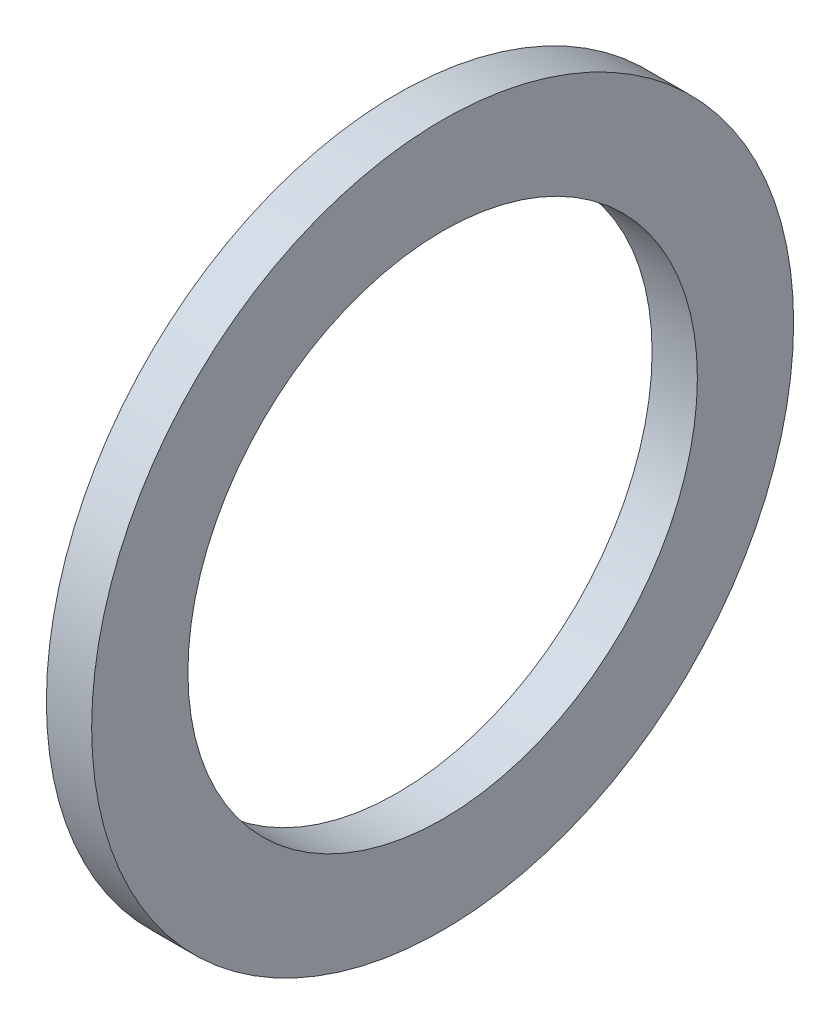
ISO-10303-21;
HEADER;
FILE_DESCRIPTION(('STEP AP214'),'2;1');
FILE_NAME('part.step','',(''),(''),'','','');
FILE_SCHEMA(('AUTOMOTIVE_DESIGN { 1 0 10303 214 1 1 1 1 }'));
ENDSEC;
DATA;
#1=APPLICATION_CONTEXT('core data for automotive mechanical design processes');
#2=APPLICATION_PROTOCOL_DEFINITION('international standard','automotive_design',2000,#1);
#3=PRODUCT_CONTEXT('',#1,'mechanical');
#4=PRODUCT('Part','Part','',(#3));
#5=PRODUCT_RELATED_PRODUCT_CATEGORY('part','',(#4));
#6=PRODUCT_DEFINITION_FORMATION('','',#4);
#7=PRODUCT_DEFINITION_CONTEXT('part definition',#1,'design');
#8=PRODUCT_DEFINITION('design','',#6,#7);
#9=PRODUCT_DEFINITION_SHAPE('','',#8);
#10=(LENGTH_UNIT() NAMED_UNIT(*) SI_UNIT(.MILLI.,.METRE.));
#11=(NAMED_UNIT(*) PLANE_ANGLE_UNIT() SI_UNIT($,.RADIAN.));
#12=(NAMED_UNIT(*) SI_UNIT($,.STERADIAN.) SOLID_ANGLE_UNIT());
#13=UNCERTAINTY_MEASURE_WITH_UNIT(LENGTH_MEASURE(1.E-05),#10,'distance_accuracy_value','');
#14=(GEOMETRIC_REPRESENTATION_CONTEXT(3) GLOBAL_UNCERTAINTY_ASSIGNED_CONTEXT((#13)) GLOBAL_UNIT_ASSIGNED_CONTEXT((#10,
#11,#12)) REPRESENTATION_CONTEXT('',''));
#15=CARTESIAN_POINT('',(0.,0.,0.));
#16=DIRECTION('',(0.,0.,1.));
#17=DIRECTION('',(1.,0.,0.));
#18=AXIS2_PLACEMENT_3D('',#15,#16,#17);
#19=CARTESIAN_POINT('',(2.,0.,0.));
#20=DIRECTION('',(1.,0.,0.));
#21=DIRECTION('',(0.,0.,-1.));
#22=AXIS2_PLACEMENT_3D('',#19,#20,#21);
#23=PLANE('',#22);
#24=CARTESIAN_POINT('',(2.,0.,0.));
#25=DIRECTION('',(1.,0.,0.));
#26=DIRECTION('',(0.,0.,-1.));
#27=AXIS2_PLACEMENT_3D('',#24,#25,#26);
#28=CIRCLE('',#27,15.5);
#29=CARTESIAN_POINT('',(2.,0.,-15.5));
#30=VERTEX_POINT('',#29);
#31=EDGE_CURVE('E10',#30,#30,#28,.T.);
#32=ORIENTED_EDGE('',*,*,#31,.T.);
#33=EDGE_LOOP('',(#32));
#34=FACE_BOUND('',#33,.T.);
#35=CARTESIAN_POINT('',(2.,0.,0.));
#36=DIRECTION('',(1.,0.,0.));
#37=DIRECTION('',(0.,0.,-1.));
#38=AXIS2_PLACEMENT_3D('',#35,#36,#37);
#39=CIRCLE('',#38,11.25);
#40=CARTESIAN_POINT('',(2.,0.,-11.25));
#41=VERTEX_POINT('',#40);
#42=EDGE_CURVE('E38',#41,#41,#39,.T.);
#43=ORIENTED_EDGE('',*,*,#42,.F.);
#44=EDGE_LOOP('',(#43));
#45=FACE_BOUND('',#44,.T.);
#46=ADVANCED_FACE('F27',(#34,#45),#23,.T.);
#47=CARTESIAN_POINT('',(0.,0.,0.));
#48=DIRECTION('',(1.,0.,0.));
#49=DIRECTION('',(0.,0.,-1.));
#50=AXIS2_PLACEMENT_3D('',#47,#48,#49);
#51=PLANE('',#50);
#52=CARTESIAN_POINT('',(0.,0.,0.));
#53=DIRECTION('',(1.,0.,0.));
#54=DIRECTION('',(0.,0.,-1.));
#55=AXIS2_PLACEMENT_3D('',#52,#53,#54);
#56=CIRCLE('',#55,15.5);
#57=CARTESIAN_POINT('',(0.,0.,-15.5));
#58=VERTEX_POINT('',#57);
#59=EDGE_CURVE('E34',#58,#58,#56,.T.);
#60=ORIENTED_EDGE('',*,*,#59,.F.);
#61=EDGE_LOOP('',(#60));
#62=FACE_BOUND('',#61,.T.);
#63=CARTESIAN_POINT('',(0.,0.,0.));
#64=DIRECTION('',(1.,0.,0.));
#65=DIRECTION('',(0.,0.,-1.));
#66=AXIS2_PLACEMENT_3D('',#63,#64,#65);
#67=CIRCLE('',#66,11.25);
#68=CARTESIAN_POINT('',(0.,0.,-11.25));
#69=VERTEX_POINT('',#68);
#70=EDGE_CURVE('E42',#69,#69,#67,.T.);
#71=ORIENTED_EDGE('',*,*,#70,.T.);
#72=EDGE_LOOP('',(#71));
#73=FACE_BOUND('',#72,.T.);
#74=ADVANCED_FACE('F48',(#62,#73),#51,.F.);
#75=CARTESIAN_POINT('',(2.,0.,0.));
#76=DIRECTION('',(-1.,0.,0.));
#77=DIRECTION('',(0.,0.,1.));
#78=AXIS2_PLACEMENT_3D('',#75,#76,#77);
#79=CYLINDRICAL_SURFACE('',#78,15.5);
#80=ORIENTED_EDGE('',*,*,#31,.F.);
#81=EDGE_LOOP('',(#80));
#82=FACE_BOUND('',#81,.T.);
#83=ORIENTED_EDGE('',*,*,#59,.T.);
#84=EDGE_LOOP('',(#83));
#85=FACE_BOUND('',#84,.T.);
#86=ADVANCED_FACE('F29',(#82,#85),#79,.T.);
#87=CARTESIAN_POINT('',(2.,0.,0.));
#88=DIRECTION('',(-1.,0.,0.));
#89=DIRECTION('',(0.,0.,1.));
#90=AXIS2_PLACEMENT_3D('',#87,#88,#89);
#91=CYLINDRICAL_SURFACE('',#90,11.25);
#92=ORIENTED_EDGE('',*,*,#42,.T.);
#93=EDGE_LOOP('',(#92));
#94=FACE_BOUND('',#93,.T.);
#95=ORIENTED_EDGE('',*,*,#70,.F.);
#96=EDGE_LOOP('',(#95));
#97=FACE_BOUND('',#96,.T.);
#98=ADVANCED_FACE('F50',(#94,#97),#91,.F.);
#99=CLOSED_SHELL('',(#46,#74,#86,#98));
#100=MANIFOLD_SOLID_BREP('B2',#99);
#101=ADVANCED_BREP_SHAPE_REPRESENTATION('',(#18,#100),#14);
#102=SHAPE_DEFINITION_REPRESENTATION(#9,#101);
ENDSEC;
END-ISO-10303-21;
